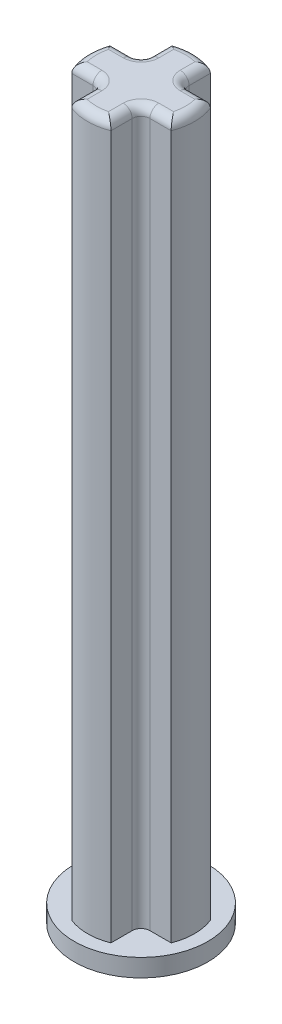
from build123d import *

# Parameters (mm, degrees)
BOSS_EXTRUDE1_DEPTH = 32
FILLET7_R           = 0.4
SKETCH2_R           = 3
BOSS_EXTRUDE2_DEPTH = 0.8


with BuildPart() as part:
    # Sketch1 → Boss-Extrude1 (new body)
    with BuildSketch(Plane(origin=(0, 0, 0), x_dir=(1, 0, 0), z_dir=(0, 1, 0))):
        with BuildLine():
            Line((-2.232845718, 0.88), (-0.88, 0.88))
            Line((-0.88, 0.88), (-0.88, 2.232845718))
            ThreePointArc((-0.88, 2.232845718), (0, 2.4), (0.88, 2.232845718))
            Line((0.88, 2.232845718), (0.88, 0.88))
            Line((0.88, 0.88), (2.232845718, 0.88))
            ThreePointArc((2.232845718, 0.88), (2.4, 0), (2.232845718, -0.88))
            Line((2.232845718, -0.88), (0.88, -0.88))
            Line((0.88, -0.88), (0.88, -2.232845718))
            ThreePointArc((0.88, -2.232845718), (0, -2.4), (-0.88, -2.232845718))
            Line((-0.88, -2.232845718), (-0.88, -0.88))
            Line((-0.88, -0.88), (-2.232845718, -0.88))
            ThreePointArc((-2.232845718, -0.88), (-2.4, 0), (-2.232845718, 0.88))
        make_face()
    extrude(amount=BOSS_EXTRUDE1_DEPTH)

    # Fillet7
    fillet7_edges = [part.edges().sort_by_distance(p)[0] for p in [
        (-2.4, 32, 0),
        (-1.556422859, 32, 0.88),
        (-0.88, 32, 1.556422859),
        (0, 32, 2.4),
        (0.88, 16, -0.88),
        (0.88, 16, 0.88),
        (-0.88, 16, 0.88),
        (-0.88, 16, -0.88),
        (0.88, 32, 1.556422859),
        (1.556422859, 32, 0.88),
        (2.4, 32, 0),
        (1.556422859, 32, -0.88),
        (0.88, 32, -1.556422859),
        (0, 32, -2.4),
        (-0.88, 32, -1.556422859),
        (-1.556422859, 32, -0.88),
    ]]
    fillet(fillet7_edges, radius=FILLET7_R)

    # Sketch2 → Boss-Extrude2 (add)
    with BuildSketch(Plane.XZ):
        with Locations(Location((0, 0, 0), (0, 0, 270))):
            Circle(SKETCH2_R)
    extrude(amount=BOSS_EXTRUDE2_DEPTH)


solid = part.part
